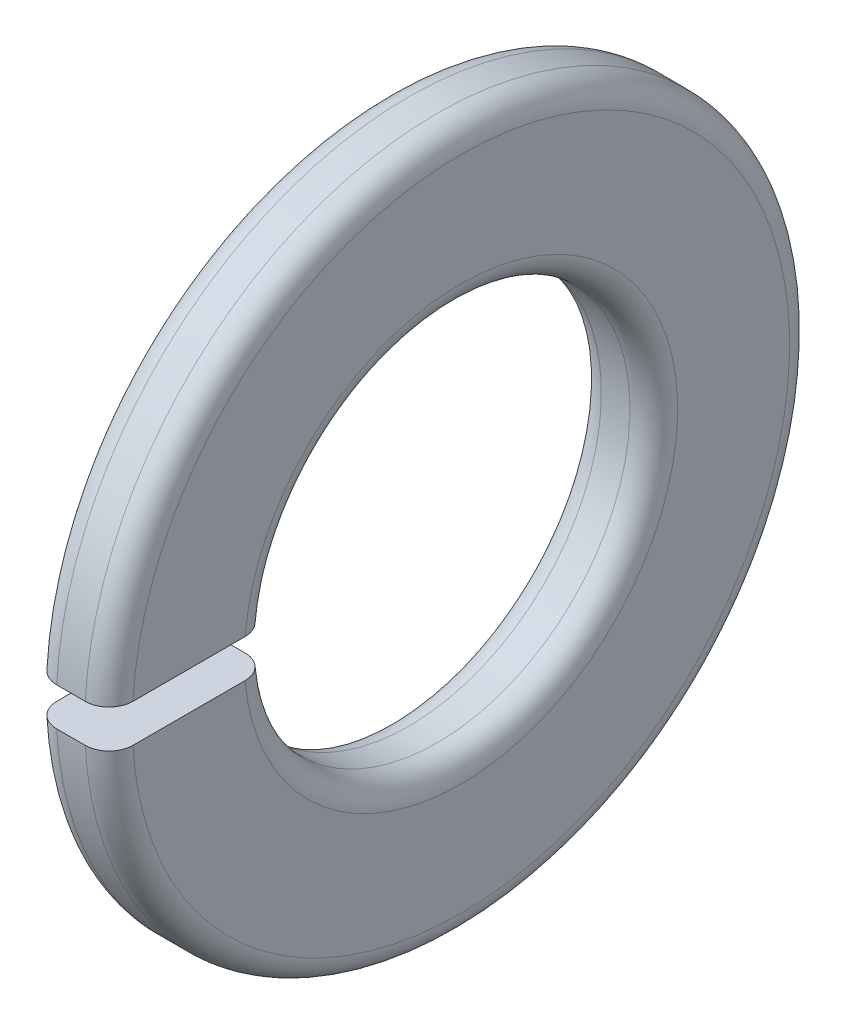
from build123d import *

# Parameters (mm, degrees)
SKETCH2_W = 0.8
SKETCH2_H = 7.548
GAP_DEPTH = 11.586784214
CONG_1_R  = 0.5


with BuildPart() as part:
    # Sketch1 → Base-Revolve (revolve)
    with BuildSketch(Plane.XY, mode=Mode.PRIVATE) as base_revolve_sk:
        with BuildLine():
            Line((0, 4.55), (0, 7.4))
            Line((0, 7.4), (-1.6, 7.4))
            Line((-1.6, 7.4), (-1.6, 4.55))
            ThreePointArc((-1.6, 4.55), (-1.453553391, 4.196446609), (-1.1, 4.05))
            Line((-1.1, 4.05), (-0.5, 4.05))
            ThreePointArc((-0.5, 4.05), (-0.146446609, 4.196446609), (0, 4.55))
        make_face()
    revolve(base_revolve_sk.sketch.rotate(Axis((-34.925, 0, 0), (1, 0, 0)), 90), axis=Axis((-34.925, 0, 0), (1, 0, 0)))

    # Sketch2 → Gap (cut, through all)
    with BuildSketch(Plane(origin=(0, 0, 0), x_dir=(0, -1, 0), z_dir=(-1, 0, 0))):
        with Locations((0, 3.774)):
            Rectangle(SKETCH2_W, SKETCH2_H)
    extrude(amount=GAP_DEPTH, mode=Mode.SUBTRACT)

    # Cong_1
    cong_1_edges = [part.edges().sort_by_distance(p)[0] for p in [
        (-1.6, 0, -7.4),
        (0, 0, -7.4),
    ]]
    fillet(cong_1_edges, radius=CONG_1_R)


solid = part.part
